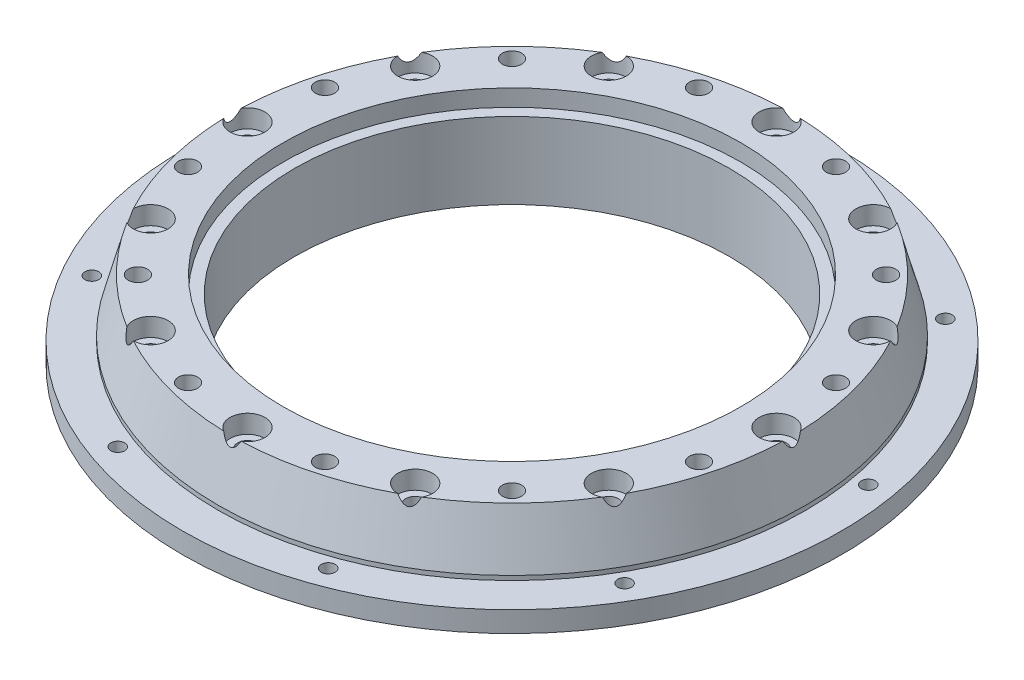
from build123d import *

# Parameters (mm, degrees)
SKETCH1_R                                      = 75
BOSS_EXTRUDE1_DEPTH                            = 21.2
SKETCH2_R                                      = 49.53
CUT_EXTRUDE1_DEPTH                             = 109.163949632
SKETCH3_OUTSIDE_W                              = 194.638
SKETCH3_OUTSIDE_H                              = 194.638
SKETCH3_OUTSIDE_R                              = 66.875
CUT_EXTRUDE2_DEPTH                             = 12
DRAFT5_ANGLE                                   = 15
SKETCH4_OUTSIDE_W                              = 194.638
SKETCH4_OUTSIDE_H                              = 194.638
SKETCH4_OUTSIDE_R                              = 66.875
CUT_EXTRUDE4_DEPTH                             = 1
TAPPED_HOLE_FOR_M3X0_5_HELICOIL2_D             = 3.15
CIRPATTERN2_COUNT                              = 9
CBORE_FOR_8_SOCKET_HEAD_CAP_SCREW1_D           = 4.4958
CBORE_FOR_8_SOCKET_HEAD_CAP_SCREW1_CBORE_D     = 7.9375
CBORE_FOR_8_SOCKET_HEAD_CAP_SCREW1_CBORE_DEPTH = 4.1656
CIRPATTERN3_COUNT                              = 12
TAPPED_HOLE_FOR_8_32_HELICOIL1_D               = 4.3942
CIRPATTERN4_COUNT                              = 12
SKETCH15_OUTSIDE_W                             = 194.638
SKETCH15_OUTSIDE_H                             = 194.638
SKETCH15_OUTSIDE_R                             = 52.07
CUT_EXTRUDE5_DEPTH                             = 3.5
CHAMFER1_SIZE                                  = 1
CUT_EXTRUDE6_START                             = -3.82
SKETCH18_R                                     = 52.07
CUT_EXTRUDE6_DEPTH                             = 3.82


with BuildPart() as part:
    # Sketch1 → Boss-Extrude1 (new body)
    with BuildSketch(Plane(origin=(0, 0, 0), x_dir=(1, 0, 0), z_dir=(0, 1, 0))):
        with Locations(Location((0, 0, 0), (0, 0, 270))):
            Circle(SKETCH1_R)
    extrude(amount=BOSS_EXTRUDE1_DEPTH)

    # Sketch2 → Cut-Extrude1 (cut, through all)
    with BuildSketch(Plane(origin=(0, 21.2, 0), x_dir=(1, 0, 0), z_dir=(0, 1, 0))):
        with Locations(Location((0, 0, 0), (0, 0, 270))):
            Circle(SKETCH2_R)
    extrude(amount=-CUT_EXTRUDE1_DEPTH, mode=Mode.SUBTRACT)

    # Sketch3 outside → Cut-Extrude2 (cut)
    with BuildSketch(Plane(origin=(0, 21.2, 0), x_dir=(1, 0, 0), z_dir=(0, 1, 0))):
        Rectangle(SKETCH3_OUTSIDE_W, SKETCH3_OUTSIDE_H)
        with Locations(Location((0, 0, 0), (0, 0, 270))):
            Circle(SKETCH3_OUTSIDE_R, mode=Mode.SUBTRACT)
    extrude(amount=-CUT_EXTRUDE2_DEPTH, mode=Mode.SUBTRACT)

    # Draft5
    draft5_faces = [part.faces().sort_by_distance(p)[0] for p in [
        (0, 15.2, -66.875),
    ]]
    draft(draft5_faces, Plane.ZX.offset(9.2), DRAFT5_ANGLE)

    # Sketch4 outside → Cut-Extrude4 (cut)
    with BuildSketch(Plane(origin=(0, 9.2, 0), x_dir=(1, 0, 0), z_dir=(0, 1, 0))):
        Rectangle(SKETCH4_OUTSIDE_W, SKETCH4_OUTSIDE_H)
        with Locations(Location((0, 0, 0), (0, 0, 270))):
            Circle(SKETCH4_OUTSIDE_R, mode=Mode.SUBTRACT)
    extrude(amount=-CUT_EXTRUDE4_DEPTH, mode=Mode.SUBTRACT)

    # Tapped Hole for M3x0.5 Helicoil2 (through all)
    with Locations(Plane(origin=(0, 21.2, 0), x_dir=(1, 0, 0), z_dir=(0, 1, 0))):
        with Locations((0, 70)):
            tapped_hole_for_m3x0_5_helicoil2 = Hole(TAPPED_HOLE_FOR_M3X0_5_HELICOIL2_D / 2)

    # CirPattern2: Tapped Hole for M3x0.5 Helicoil2 ×9 about axis
    cirpattern2_axis = Axis((0, 0, 0), (0, 1, 0))
    for i in range(1, CIRPATTERN2_COUNT):
        add(tapped_hole_for_m3x0_5_helicoil2.rotate(cirpattern2_axis, i * 360 / CIRPATTERN2_COUNT), mode=Mode.SUBTRACT)

    # CBORE for _8 Socket Head Cap Screw1 (through all)
    with Locations(Plane(origin=(0, 21.2, 0), x_dir=(1, 0, 0), z_dir=(0, 1, 0))):
        with Locations((0, 60.198)):
            cbore_for_8_socket_head_cap_screw1 = CounterBoreHole(CBORE_FOR_8_SOCKET_HEAD_CAP_SCREW1_D / 2, CBORE_FOR_8_SOCKET_HEAD_CAP_SCREW1_CBORE_D / 2, CBORE_FOR_8_SOCKET_HEAD_CAP_SCREW1_CBORE_DEPTH)

    # CirPattern3: CBORE for _8 Socket Head Cap Screw1 ×12 about axis
    cirpattern3_axis = Axis((0, 0, 0), (0, 1, 0))
    for i in range(1, CIRPATTERN3_COUNT):
        add(cbore_for_8_socket_head_cap_screw1.rotate(cirpattern3_axis, i * 360 / CIRPATTERN3_COUNT), mode=Mode.SUBTRACT)

    # Tapped Hole for _8-32 Helicoil1 (through all)
    with Locations(Plane(origin=(0, 21.2, 0), x_dir=(1, 0, 0), z_dir=(0, 1, 0))):
        with Locations((15.580388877, 58.146802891)):
            tapped_hole_for_8_32_helicoil1 = Hole(TAPPED_HOLE_FOR_8_32_HELICOIL1_D / 2)

    # CirPattern4: Tapped Hole for _8-32 Helicoil1 ×12 about axis
    cirpattern4_axis = Axis((0, 0, 0), (0, 1, 0))
    for i in range(1, CIRPATTERN4_COUNT):
        add(tapped_hole_for_8_32_helicoil1.rotate(cirpattern4_axis, i * 360 / CIRPATTERN4_COUNT), mode=Mode.SUBTRACT)

    # Sketch15 outside → Cut-Extrude5 (cut)
    with BuildSketch(Plane(origin=(0, 0, 0), x_dir=(-1, 0, 0), z_dir=(0, -1, 0))):
        Rectangle(SKETCH15_OUTSIDE_W, SKETCH15_OUTSIDE_H)
        with Locations(Location((0, 0, 0), (0, 0, 90))):
            Circle(SKETCH15_OUTSIDE_R, mode=Mode.SUBTRACT)
    extrude(amount=-CUT_EXTRUDE5_DEPTH, mode=Mode.SUBTRACT)

    # Chamfer1
    chamfer1_edges = [part.edges().sort_by_distance(p)[0] for p in [
        (0, 0, 52.07),
    ]]
    chamfer(chamfer1_edges, length=CHAMFER1_SIZE)

    # Sketch18 → Cut-Extrude6 (cut)
    with BuildSketch(Plane(origin=(0, 21.2, 0), x_dir=(1, 0, 0), z_dir=(0, 1, 0)).offset(CUT_EXTRUDE6_START)):
        with Locations(Location((0, 0, 0), (0, 0, 90))):
            Circle(SKETCH18_R)
    extrude(amount=CUT_EXTRUDE6_DEPTH, mode=Mode.SUBTRACT)


solid = part.part
